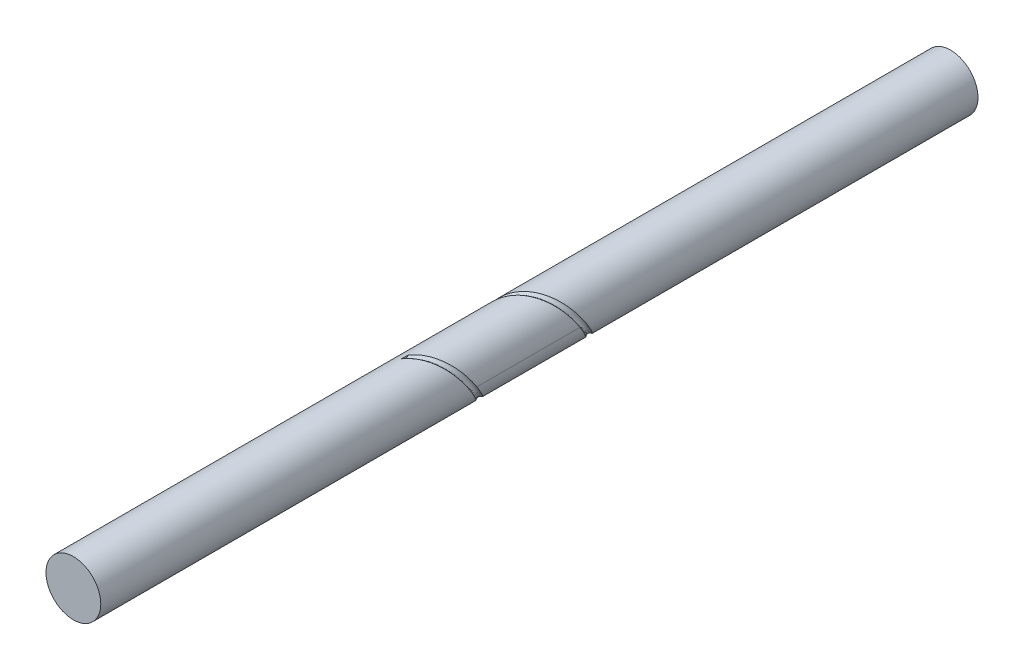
from build123d import *

# Parameters (mm, degrees)
SKETCH1_R              = 25
BOSS_EXTRUDE1_DEPTH    = 800
CUT_SWEEP1_PITCH       = 100
CUT_SWEEP1_HEIGHT      = 180
CUT_SWEEP1_RADIUS      = 27.646
CUT_SWEEP1_START_ANGLE = -180
SKETCH3_R              = 3.969


with BuildPart() as part:
    # Sketch1 → Boss-Extrude1 (new body)
    with BuildSketch(Plane.XY):
        Circle(SKETCH1_R)
    extrude(amount=BOSS_EXTRUDE1_DEPTH)

    # Cut-Sweep1: sweep along a helix
    with BuildLine() as cut_sweep1_path:
        add(Helix(CUT_SWEEP1_PITCH, CUT_SWEEP1_HEIGHT, CUT_SWEEP1_RADIUS, center=(0, 0, 310), direction=(0, 0, 1), mode=Mode.PRIVATE).rotate(Axis((0, 0, 310), (0, 0, 1)), CUT_SWEEP1_START_ANGLE))
    # Sketch3 → Cut-Sweep1 (sweep, cut)
    with BuildSketch(Plane(origin=(0, 0, 0), x_dir=(1, 0, 0), z_dir=(0, 1, 0))):
        with Locations((-27.646, -310)):
            Circle(SKETCH3_R)
    sweep(path=cut_sweep1_path.line, is_frenet=True, mode=Mode.SUBTRACT)


solid = part.part
